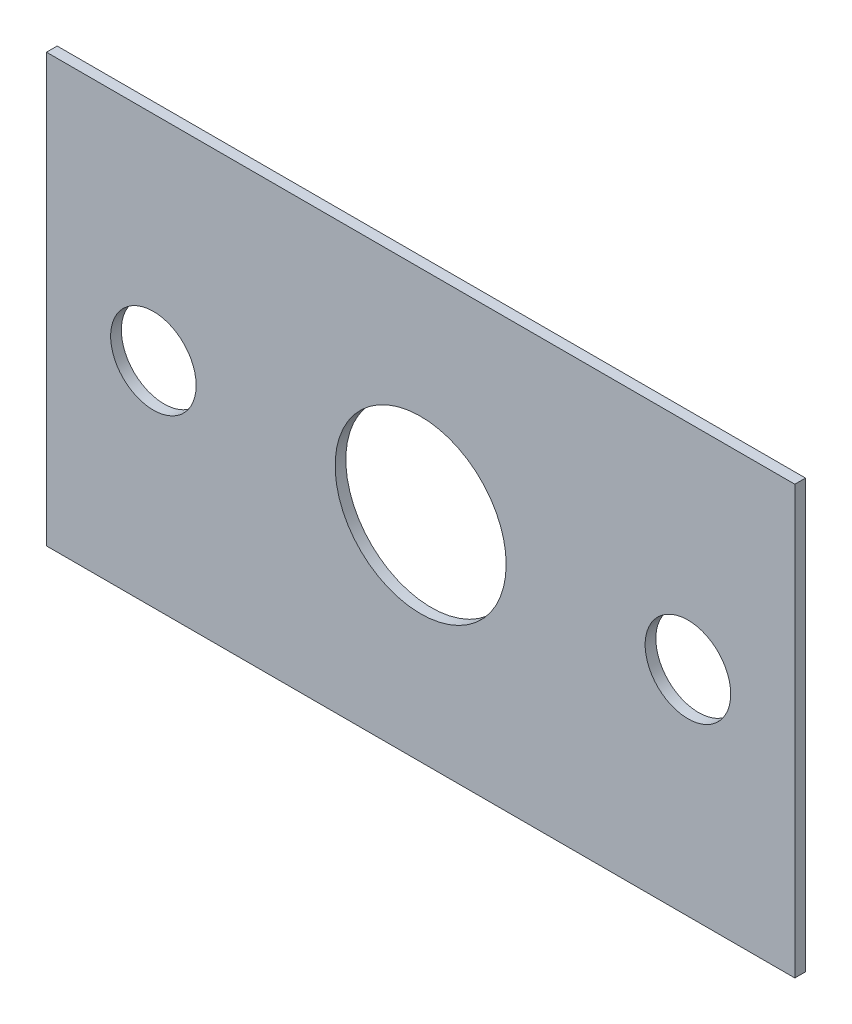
from build123d import *

# Parameters (mm, degrees)
CROQUIS1_W     = 70
CROQUIS1_H     = 40
CROQUIS1_R     = 8
CROQUIS1_R_2   = 4
EXTRUIR1_DEPTH = 1


with BuildPart() as part:
    # Croquis1 → Extruir1 (new body)
    with BuildSketch(Plane.XY):
        Rectangle(CROQUIS1_W, CROQUIS1_H)
        Circle(CROQUIS1_R, mode=Mode.SUBTRACT)
        with Locations((-25, 0)):
            Circle(CROQUIS1_R_2, mode=Mode.SUBTRACT)
        with Locations((25, 0)):
            Circle(CROQUIS1_R_2, mode=Mode.SUBTRACT)
    extrude(amount=EXTRUIR1_DEPTH)


solid = part.part
